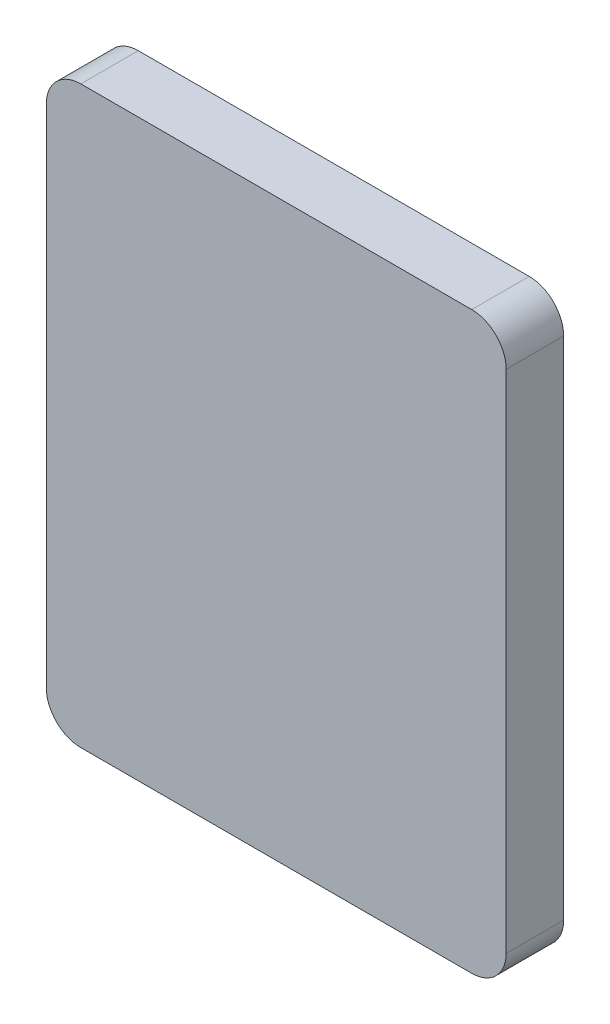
ISO-10303-21;
HEADER;
FILE_DESCRIPTION(('STEP AP214'),'2;1');
FILE_NAME('part.step','',(''),(''),'','','');
FILE_SCHEMA(('AUTOMOTIVE_DESIGN { 1 0 10303 214 1 1 1 1 }'));
ENDSEC;
DATA;
#1=APPLICATION_CONTEXT('core data for automotive mechanical design processes');
#2=APPLICATION_PROTOCOL_DEFINITION('international standard','automotive_design',2000,#1);
#3=PRODUCT_CONTEXT('',#1,'mechanical');
#4=PRODUCT('Part','Part','',(#3));
#5=PRODUCT_RELATED_PRODUCT_CATEGORY('part','',(#4));
#6=PRODUCT_DEFINITION_FORMATION('','',#4);
#7=PRODUCT_DEFINITION_CONTEXT('part definition',#1,'design');
#8=PRODUCT_DEFINITION('design','',#6,#7);
#9=PRODUCT_DEFINITION_SHAPE('','',#8);
#10=(LENGTH_UNIT() NAMED_UNIT(*) SI_UNIT(.MILLI.,.METRE.));
#11=(NAMED_UNIT(*) PLANE_ANGLE_UNIT() SI_UNIT($,.RADIAN.));
#12=(NAMED_UNIT(*) SI_UNIT($,.STERADIAN.) SOLID_ANGLE_UNIT());
#13=UNCERTAINTY_MEASURE_WITH_UNIT(LENGTH_MEASURE(1.E-05),#10,'distance_accuracy_value','');
#14=(GEOMETRIC_REPRESENTATION_CONTEXT(3) GLOBAL_UNCERTAINTY_ASSIGNED_CONTEXT((#13)) GLOBAL_UNIT_ASSIGNED_CONTEXT((#10,
#11,#12)) REPRESENTATION_CONTEXT('',''));
#15=CARTESIAN_POINT('',(0.,0.,0.));
#16=DIRECTION('',(0.,0.,1.));
#17=DIRECTION('',(1.,0.,0.));
#18=AXIS2_PLACEMENT_3D('',#15,#16,#17);
#19=CARTESIAN_POINT('',(-20.,-25.,2.5));
#20=DIRECTION('',(1.,0.,0.));
#21=DIRECTION('',(0.,0.,-1.));
#22=AXIS2_PLACEMENT_3D('',#19,#20,#21);
#23=PLANE('',#22);
#24=DIRECTION('',(0.,-1.,0.));
#25=VECTOR('',#24,1.);
#26=CARTESIAN_POINT('',(-20.,-25.,-2.5));
#27=LINE('',#26,#25);
#28=CARTESIAN_POINT('',(-20.,22.,-2.5));
#29=VERTEX_POINT('',#28);
#30=CARTESIAN_POINT('',(-20.,-22.,-2.5));
#31=VERTEX_POINT('',#30);
#32=EDGE_CURVE('E126',#29,#31,#27,.T.);
#33=ORIENTED_EDGE('',*,*,#32,.T.);
#34=DIRECTION('',(0.,0.,-1.));
#35=VECTOR('',#34,1.);
#36=CARTESIAN_POINT('',(-20.,-22.,2.5));
#37=LINE('',#36,#35);
#38=CARTESIAN_POINT('',(-20.,-22.,2.5));
#39=VERTEX_POINT('',#38);
#40=EDGE_CURVE('E104',#31,#39,#37,.F.);
#41=ORIENTED_EDGE('',*,*,#40,.T.);
#42=DIRECTION('',(0.,-1.,0.));
#43=VECTOR('',#42,1.);
#44=CARTESIAN_POINT('',(-20.,-25.,2.5));
#45=LINE('',#44,#43);
#46=CARTESIAN_POINT('',(-20.,22.,2.5));
#47=VERTEX_POINT('',#46);
#48=EDGE_CURVE('E135',#47,#39,#45,.T.);
#49=ORIENTED_EDGE('',*,*,#48,.F.);
#50=DIRECTION('',(0.,0.,-1.));
#51=VECTOR('',#50,1.);
#52=CARTESIAN_POINT('',(-20.,22.,2.5));
#53=LINE('',#52,#51);
#54=EDGE_CURVE('E109',#47,#29,#53,.T.);
#55=ORIENTED_EDGE('',*,*,#54,.T.);
#56=EDGE_LOOP('',(#33,#41,#49,#55));
#57=FACE_BOUND('',#56,.T.);
#58=ADVANCED_FACE('F33',(#57),#23,.F.);
#59=CARTESIAN_POINT('',(20.,-25.,2.5));
#60=DIRECTION('',(0.,1.,0.));
#61=DIRECTION('',(-1.,0.,0.));
#62=AXIS2_PLACEMENT_3D('',#59,#60,#61);
#63=PLANE('',#62);
#64=DIRECTION('',(1.,0.,0.));
#65=VECTOR('',#64,1.);
#66=CARTESIAN_POINT('',(20.,-25.,2.5));
#67=LINE('',#66,#65);
#68=CARTESIAN_POINT('',(-17.,-25.,2.5));
#69=VERTEX_POINT('',#68);
#70=CARTESIAN_POINT('',(17.,-25.,2.5));
#71=VERTEX_POINT('',#70);
#72=EDGE_CURVE('E119',#69,#71,#67,.T.);
#73=ORIENTED_EDGE('',*,*,#72,.F.);
#74=DIRECTION('',(0.,0.,-1.));
#75=VECTOR('',#74,1.);
#76=CARTESIAN_POINT('',(-17.,-25.,2.5));
#77=LINE('',#76,#75);
#78=CARTESIAN_POINT('',(-17.,-25.,-2.5));
#79=VERTEX_POINT('',#78);
#80=EDGE_CURVE('E103',#69,#79,#77,.T.);
#81=ORIENTED_EDGE('',*,*,#80,.T.);
#82=DIRECTION('',(1.,0.,0.));
#83=VECTOR('',#82,1.);
#84=CARTESIAN_POINT('',(20.,-25.,-2.5));
#85=LINE('',#84,#83);
#86=CARTESIAN_POINT('',(17.,-25.,-2.5));
#87=VERTEX_POINT('',#86);
#88=EDGE_CURVE('E116',#79,#87,#85,.T.);
#89=ORIENTED_EDGE('',*,*,#88,.T.);
#90=DIRECTION('',(0.,0.,-1.));
#91=VECTOR('',#90,1.);
#92=CARTESIAN_POINT('',(17.,-25.,2.5));
#93=LINE('',#92,#91);
#94=EDGE_CURVE('E121',#87,#71,#93,.F.);
#95=ORIENTED_EDGE('',*,*,#94,.T.);
#96=EDGE_LOOP('',(#73,#81,#89,#95));
#97=FACE_BOUND('',#96,.T.);
#98=ADVANCED_FACE('F115',(#97),#63,.F.);
#99=CARTESIAN_POINT('',(20.,-25.,2.5));
#100=DIRECTION('',(-1.,0.,0.));
#101=DIRECTION('',(0.,0.,1.));
#102=AXIS2_PLACEMENT_3D('',#99,#100,#101);
#103=PLANE('',#102);
#104=DIRECTION('',(0.,1.,0.));
#105=VECTOR('',#104,1.);
#106=CARTESIAN_POINT('',(20.,-25.,2.5));
#107=LINE('',#106,#105);
#108=CARTESIAN_POINT('',(20.,-22.,2.5));
#109=VERTEX_POINT('',#108);
#110=CARTESIAN_POINT('',(20.,22.,2.5));
#111=VERTEX_POINT('',#110);
#112=EDGE_CURVE('E161',#109,#111,#107,.T.);
#113=ORIENTED_EDGE('',*,*,#112,.F.);
#114=DIRECTION('',(0.,0.,-1.));
#115=VECTOR('',#114,1.);
#116=CARTESIAN_POINT('',(20.,-22.,2.5));
#117=LINE('',#116,#115);
#118=CARTESIAN_POINT('',(20.,-22.,-2.5));
#119=VERTEX_POINT('',#118);
#120=EDGE_CURVE('E154',#109,#119,#117,.T.);
#121=ORIENTED_EDGE('',*,*,#120,.T.);
#122=DIRECTION('',(0.,1.,0.));
#123=VECTOR('',#122,1.);
#124=CARTESIAN_POINT('',(20.,-25.,-2.5));
#125=LINE('',#124,#123);
#126=CARTESIAN_POINT('',(20.,22.,-2.5));
#127=VERTEX_POINT('',#126);
#128=EDGE_CURVE('E125',#119,#127,#125,.T.);
#129=ORIENTED_EDGE('',*,*,#128,.T.);
#130=DIRECTION('',(0.,0.,-1.));
#131=VECTOR('',#130,1.);
#132=CARTESIAN_POINT('',(20.,22.,2.5));
#133=LINE('',#132,#131);
#134=EDGE_CURVE('E152',#127,#111,#133,.F.);
#135=ORIENTED_EDGE('',*,*,#134,.T.);
#136=EDGE_LOOP('',(#113,#121,#129,#135));
#137=FACE_BOUND('',#136,.T.);
#138=ADVANCED_FACE('F159',(#137),#103,.F.);
#139=CARTESIAN_POINT('',(20.,25.,2.5));
#140=DIRECTION('',(0.,-1.,0.));
#141=DIRECTION('',(1.,0.,0.));
#142=AXIS2_PLACEMENT_3D('',#139,#140,#141);
#143=PLANE('',#142);
#144=DIRECTION('',(-1.,0.,0.));
#145=VECTOR('',#144,1.);
#146=CARTESIAN_POINT('',(20.,25.,2.5));
#147=LINE('',#146,#145);
#148=CARTESIAN_POINT('',(17.,25.,2.5));
#149=VERTEX_POINT('',#148);
#150=CARTESIAN_POINT('',(-17.,25.,2.5));
#151=VERTEX_POINT('',#150);
#152=EDGE_CURVE('E136',#149,#151,#147,.T.);
#153=ORIENTED_EDGE('',*,*,#152,.F.);
#154=DIRECTION('',(0.,0.,-1.));
#155=VECTOR('',#154,1.);
#156=CARTESIAN_POINT('',(17.,25.,2.5));
#157=LINE('',#156,#155);
#158=CARTESIAN_POINT('',(17.,25.,-2.5));
#159=VERTEX_POINT('',#158);
#160=EDGE_CURVE('E11',#149,#159,#157,.T.);
#161=ORIENTED_EDGE('',*,*,#160,.T.);
#162=DIRECTION('',(-1.,0.,0.));
#163=VECTOR('',#162,1.);
#164=CARTESIAN_POINT('',(20.,25.,-2.5));
#165=LINE('',#164,#163);
#166=CARTESIAN_POINT('',(-17.,25.,-2.5));
#167=VERTEX_POINT('',#166);
#168=EDGE_CURVE('E129',#159,#167,#165,.T.);
#169=ORIENTED_EDGE('',*,*,#168,.T.);
#170=DIRECTION('',(0.,0.,-1.));
#171=VECTOR('',#170,1.);
#172=CARTESIAN_POINT('',(-17.,25.,2.5));
#173=LINE('',#172,#171);
#174=EDGE_CURVE('E41',#167,#151,#173,.F.);
#175=ORIENTED_EDGE('',*,*,#174,.T.);
#176=EDGE_LOOP('',(#153,#161,#169,#175));
#177=FACE_BOUND('',#176,.T.);
#178=ADVANCED_FACE('F168',(#177),#143,.F.);
#179=CARTESIAN_POINT('',(0.,0.,2.5));
#180=DIRECTION('',(0.,0.,1.));
#181=DIRECTION('',(1.,0.,0.));
#182=AXIS2_PLACEMENT_3D('',#179,#180,#181);
#183=PLANE('',#182);
#184=ORIENTED_EDGE('',*,*,#48,.T.);
#185=CARTESIAN_POINT('',(-17.,-22.,2.5));
#186=DIRECTION('',(0.,0.,1.));
#187=DIRECTION('',(1.,0.,0.));
#188=AXIS2_PLACEMENT_3D('',#185,#186,#187);
#189=CIRCLE('',#188,3.);
#190=EDGE_CURVE('E150',#39,#69,#189,.T.);
#191=ORIENTED_EDGE('',*,*,#190,.T.);
#192=ORIENTED_EDGE('',*,*,#72,.T.);
#193=CARTESIAN_POINT('',(17.,-22.,2.5));
#194=DIRECTION('',(0.,0.,1.));
#195=DIRECTION('',(1.,0.,0.));
#196=AXIS2_PLACEMENT_3D('',#193,#194,#195);
#197=CIRCLE('',#196,3.);
#198=EDGE_CURVE('E148',#71,#109,#197,.T.);
#199=ORIENTED_EDGE('',*,*,#198,.T.);
#200=ORIENTED_EDGE('',*,*,#112,.T.);
#201=CARTESIAN_POINT('',(17.,22.,2.5));
#202=DIRECTION('',(0.,0.,1.));
#203=DIRECTION('',(1.,0.,0.));
#204=AXIS2_PLACEMENT_3D('',#201,#202,#203);
#205=CIRCLE('',#204,3.);
#206=EDGE_CURVE('E54',#111,#149,#205,.T.);
#207=ORIENTED_EDGE('',*,*,#206,.T.);
#208=ORIENTED_EDGE('',*,*,#152,.T.);
#209=CARTESIAN_POINT('',(-17.,22.,2.5));
#210=DIRECTION('',(0.,0.,1.));
#211=DIRECTION('',(1.,0.,0.));
#212=AXIS2_PLACEMENT_3D('',#209,#210,#211);
#213=CIRCLE('',#212,3.);
#214=EDGE_CURVE('E145',#151,#47,#213,.T.);
#215=ORIENTED_EDGE('',*,*,#214,.T.);
#216=EDGE_LOOP('',(#184,#191,#192,#199,#200,#207,#208,#215));
#217=FACE_BOUND('',#216,.T.);
#218=ADVANCED_FACE('F175',(#217),#183,.T.);
#219=CARTESIAN_POINT('',(0.,0.,-2.5));
#220=DIRECTION('',(0.,0.,1.));
#221=DIRECTION('',(1.,0.,0.));
#222=AXIS2_PLACEMENT_3D('',#219,#220,#221);
#223=PLANE('',#222);
#224=ORIENTED_EDGE('',*,*,#88,.F.);
#225=CARTESIAN_POINT('',(-17.,-22.,-2.5));
#226=DIRECTION('',(0.,0.,1.));
#227=DIRECTION('',(1.,0.,0.));
#228=AXIS2_PLACEMENT_3D('',#225,#226,#227);
#229=CIRCLE('',#228,3.);
#230=EDGE_CURVE('E99',#79,#31,#229,.F.);
#231=ORIENTED_EDGE('',*,*,#230,.T.);
#232=ORIENTED_EDGE('',*,*,#32,.F.);
#233=CARTESIAN_POINT('',(-17.,22.,-2.5));
#234=DIRECTION('',(0.,0.,1.));
#235=DIRECTION('',(1.,0.,0.));
#236=AXIS2_PLACEMENT_3D('',#233,#234,#235);
#237=CIRCLE('',#236,3.);
#238=EDGE_CURVE('E120',#29,#167,#237,.F.);
#239=ORIENTED_EDGE('',*,*,#238,.T.);
#240=ORIENTED_EDGE('',*,*,#168,.F.);
#241=CARTESIAN_POINT('',(17.,22.,-2.5));
#242=DIRECTION('',(0.,0.,1.));
#243=DIRECTION('',(1.,0.,0.));
#244=AXIS2_PLACEMENT_3D('',#241,#242,#243);
#245=CIRCLE('',#244,3.);
#246=EDGE_CURVE('E139',#159,#127,#245,.F.);
#247=ORIENTED_EDGE('',*,*,#246,.T.);
#248=ORIENTED_EDGE('',*,*,#128,.F.);
#249=CARTESIAN_POINT('',(17.,-22.,-2.5));
#250=DIRECTION('',(0.,0.,1.));
#251=DIRECTION('',(1.,0.,0.));
#252=AXIS2_PLACEMENT_3D('',#249,#250,#251);
#253=CIRCLE('',#252,3.);
#254=EDGE_CURVE('E110',#119,#87,#253,.F.);
#255=ORIENTED_EDGE('',*,*,#254,.T.);
#256=EDGE_LOOP('',(#224,#231,#232,#239,#240,#247,#248,#255));
#257=FACE_BOUND('',#256,.T.);
#258=ADVANCED_FACE('F123',(#257),#223,.F.);
#259=CARTESIAN_POINT('',(-17.,-22.,2.5));
#260=DIRECTION('',(0.,0.,-1.));
#261=DIRECTION('',(-1.,0.,0.));
#262=AXIS2_PLACEMENT_3D('',#259,#260,#261);
#263=CYLINDRICAL_SURFACE('',#262,3.);
#264=ORIENTED_EDGE('',*,*,#190,.F.);
#265=ORIENTED_EDGE('',*,*,#40,.F.);
#266=ORIENTED_EDGE('',*,*,#230,.F.);
#267=ORIENTED_EDGE('',*,*,#80,.F.);
#268=EDGE_LOOP('',(#264,#265,#266,#267));
#269=FACE_BOUND('',#268,.T.);
#270=ADVANCED_FACE('F102',(#269),#263,.T.);
#271=CARTESIAN_POINT('',(17.,-22.,2.5));
#272=DIRECTION('',(0.,0.,-1.));
#273=DIRECTION('',(-1.,0.,0.));
#274=AXIS2_PLACEMENT_3D('',#271,#272,#273);
#275=CYLINDRICAL_SURFACE('',#274,3.);
#276=ORIENTED_EDGE('',*,*,#198,.F.);
#277=ORIENTED_EDGE('',*,*,#94,.F.);
#278=ORIENTED_EDGE('',*,*,#254,.F.);
#279=ORIENTED_EDGE('',*,*,#120,.F.);
#280=EDGE_LOOP('',(#276,#277,#278,#279));
#281=FACE_BOUND('',#280,.T.);
#282=ADVANCED_FACE('F183',(#281),#275,.T.);
#283=CARTESIAN_POINT('',(17.,22.,2.5));
#284=DIRECTION('',(0.,0.,-1.));
#285=DIRECTION('',(-1.,0.,0.));
#286=AXIS2_PLACEMENT_3D('',#283,#284,#285);
#287=CYLINDRICAL_SURFACE('',#286,3.);
#288=ORIENTED_EDGE('',*,*,#206,.F.);
#289=ORIENTED_EDGE('',*,*,#134,.F.);
#290=ORIENTED_EDGE('',*,*,#246,.F.);
#291=ORIENTED_EDGE('',*,*,#160,.F.);
#292=EDGE_LOOP('',(#288,#289,#290,#291));
#293=FACE_BOUND('',#292,.T.);
#294=ADVANCED_FACE('F167',(#293),#287,.T.);
#295=CARTESIAN_POINT('',(-17.,22.,2.5));
#296=DIRECTION('',(0.,0.,-1.));
#297=DIRECTION('',(-1.,0.,0.));
#298=AXIS2_PLACEMENT_3D('',#295,#296,#297);
#299=CYLINDRICAL_SURFACE('',#298,3.);
#300=ORIENTED_EDGE('',*,*,#214,.F.);
#301=ORIENTED_EDGE('',*,*,#174,.F.);
#302=ORIENTED_EDGE('',*,*,#238,.F.);
#303=ORIENTED_EDGE('',*,*,#54,.F.);
#304=EDGE_LOOP('',(#300,#301,#302,#303));
#305=FACE_BOUND('',#304,.T.);
#306=ADVANCED_FACE('F35',(#305),#299,.T.);
#307=CLOSED_SHELL('',(#58,#98,#138,#178,#218,#258,#270,#282,#294,#306));
#308=MANIFOLD_SOLID_BREP('B2',#307);
#309=ADVANCED_BREP_SHAPE_REPRESENTATION('',(#18,#308),#14);
#310=SHAPE_DEFINITION_REPRESENTATION(#9,#309);
ENDSEC;
END-ISO-10303-21;
